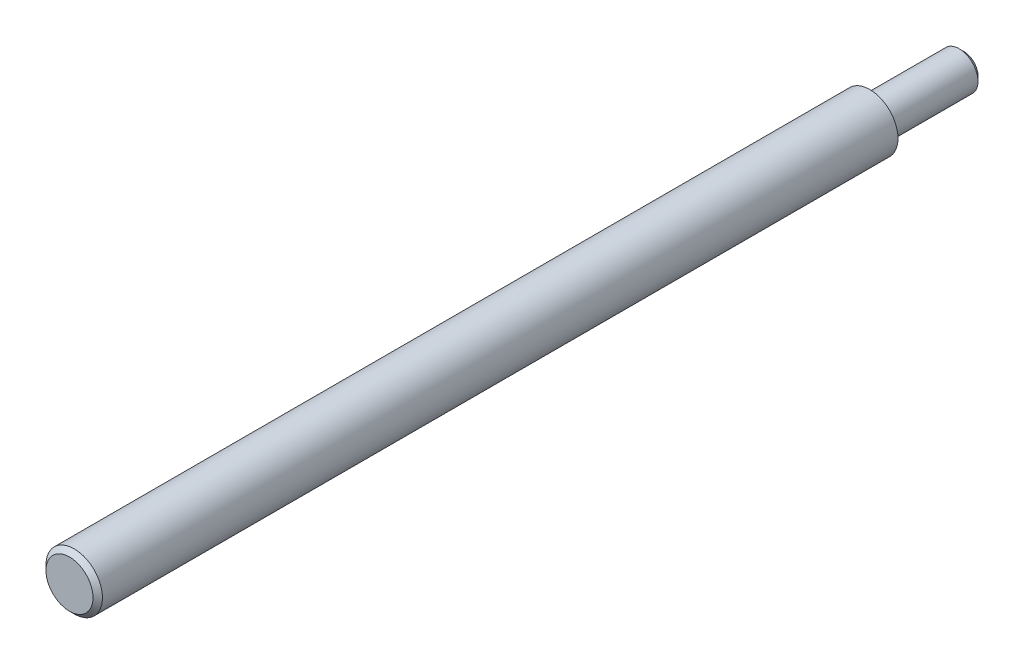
ISO-10303-21;
HEADER;
FILE_DESCRIPTION(('STEP AP214'),'2;1');
FILE_NAME('part.step','',(''),(''),'','','');
FILE_SCHEMA(('AUTOMOTIVE_DESIGN { 1 0 10303 214 1 1 1 1 }'));
ENDSEC;
DATA;
#1=APPLICATION_CONTEXT('core data for automotive mechanical design processes');
#2=APPLICATION_PROTOCOL_DEFINITION('international standard','automotive_design',2000,#1);
#3=PRODUCT_CONTEXT('',#1,'mechanical');
#4=PRODUCT('Part','Part','',(#3));
#5=PRODUCT_RELATED_PRODUCT_CATEGORY('part','',(#4));
#6=PRODUCT_DEFINITION_FORMATION('','',#4);
#7=PRODUCT_DEFINITION_CONTEXT('part definition',#1,'design');
#8=PRODUCT_DEFINITION('design','',#6,#7);
#9=PRODUCT_DEFINITION_SHAPE('','',#8);
#10=(LENGTH_UNIT() NAMED_UNIT(*) SI_UNIT(.MILLI.,.METRE.));
#11=(NAMED_UNIT(*) PLANE_ANGLE_UNIT() SI_UNIT($,.RADIAN.));
#12=(NAMED_UNIT(*) SI_UNIT($,.STERADIAN.) SOLID_ANGLE_UNIT());
#13=UNCERTAINTY_MEASURE_WITH_UNIT(LENGTH_MEASURE(1.E-05),#10,'distance_accuracy_value','');
#14=(GEOMETRIC_REPRESENTATION_CONTEXT(3) GLOBAL_UNCERTAINTY_ASSIGNED_CONTEXT((#13)) GLOBAL_UNIT_ASSIGNED_CONTEXT((#10,
#11,#12)) REPRESENTATION_CONTEXT('',''));
#15=CARTESIAN_POINT('',(0.,0.,0.));
#16=DIRECTION('',(0.,0.,1.));
#17=DIRECTION('',(1.,0.,0.));
#18=AXIS2_PLACEMENT_3D('',#15,#16,#17);
#19=CARTESIAN_POINT('',(0.,0.,170.));
#20=DIRECTION('',(0.,0.,-1.));
#21=DIRECTION('',(-1.,0.,0.));
#22=AXIS2_PLACEMENT_3D('',#19,#20,#21);
#23=CYLINDRICAL_SURFACE('',#22,6.);
#24=CARTESIAN_POINT('',(0.,0.,169.));
#25=DIRECTION('',(0.,0.,1.));
#26=DIRECTION('',(1.,0.,0.));
#27=AXIS2_PLACEMENT_3D('',#24,#25,#26);
#28=CIRCLE('',#27,6.);
#29=CARTESIAN_POINT('',(6.,0.,169.));
#30=VERTEX_POINT('',#29);
#31=EDGE_CURVE('E48',#30,#30,#28,.F.);
#32=ORIENTED_EDGE('',*,*,#31,.T.);
#33=EDGE_LOOP('',(#32));
#34=FACE_BOUND('',#33,.T.);
#35=CARTESIAN_POINT('',(0.,0.,0.));
#36=DIRECTION('',(0.,0.,1.));
#37=DIRECTION('',(1.,0.,0.));
#38=AXIS2_PLACEMENT_3D('',#35,#36,#37);
#39=CIRCLE('',#38,6.);
#40=CARTESIAN_POINT('',(6.,0.,0.));
#41=VERTEX_POINT('',#40);
#42=EDGE_CURVE('E60',#41,#41,#39,.T.);
#43=ORIENTED_EDGE('',*,*,#42,.T.);
#44=EDGE_LOOP('',(#43));
#45=FACE_BOUND('',#44,.T.);
#46=ADVANCED_FACE('F37',(#34,#45),#23,.T.);
#47=CARTESIAN_POINT('',(0.,0.,170.));
#48=DIRECTION('',(0.,0.,1.));
#49=DIRECTION('',(1.,0.,0.));
#50=AXIS2_PLACEMENT_3D('',#47,#48,#49);
#51=PLANE('',#50);
#52=CARTESIAN_POINT('',(0.,0.,170.));
#53=DIRECTION('',(0.,0.,1.));
#54=DIRECTION('',(1.,0.,0.));
#55=AXIS2_PLACEMENT_3D('',#52,#53,#54);
#56=CIRCLE('',#55,5.);
#57=CARTESIAN_POINT('',(5.,0.,170.));
#58=VERTEX_POINT('',#57);
#59=EDGE_CURVE('E52',#58,#58,#56,.T.);
#60=ORIENTED_EDGE('',*,*,#59,.T.);
#61=EDGE_LOOP('',(#60));
#62=FACE_BOUND('',#61,.T.);
#63=ADVANCED_FACE('F68',(#62),#51,.T.);
#64=CARTESIAN_POINT('',(0.,0.,0.));
#65=DIRECTION('',(0.,0.,1.));
#66=DIRECTION('',(1.,0.,0.));
#67=AXIS2_PLACEMENT_3D('',#64,#65,#66);
#68=PLANE('',#67);
#69=CARTESIAN_POINT('',(0.,0.,0.));
#70=DIRECTION('',(0.,0.,1.));
#71=DIRECTION('',(1.,0.,0.));
#72=AXIS2_PLACEMENT_3D('',#69,#70,#71);
#73=CIRCLE('',#72,4.);
#74=CARTESIAN_POINT('',(4.,0.,0.));
#75=VERTEX_POINT('',#74);
#76=EDGE_CURVE('E57',#75,#75,#73,.F.);
#77=ORIENTED_EDGE('',*,*,#76,.F.);
#78=EDGE_LOOP('',(#77));
#79=FACE_BOUND('',#78,.T.);
#80=ORIENTED_EDGE('',*,*,#42,.F.);
#81=EDGE_LOOP('',(#80));
#82=FACE_BOUND('',#81,.T.);
#83=ADVANCED_FACE('F65',(#79,#82),#68,.F.);
#84=CARTESIAN_POINT('',(0.,0.,-20.));
#85=DIRECTION('',(0.,0.,1.));
#86=DIRECTION('',(1.,0.,0.));
#87=AXIS2_PLACEMENT_3D('',#84,#85,#86);
#88=CYLINDRICAL_SURFACE('',#87,4.);
#89=CARTESIAN_POINT('',(0.,0.,-19.));
#90=DIRECTION('',(0.,0.,-1.));
#91=DIRECTION('',(-1.,0.,0.));
#92=AXIS2_PLACEMENT_3D('',#89,#90,#91);
#93=CIRCLE('',#92,4.);
#94=CARTESIAN_POINT('',(-4.,0.,-19.));
#95=VERTEX_POINT('',#94);
#96=EDGE_CURVE('E10',#95,#95,#93,.F.);
#97=ORIENTED_EDGE('',*,*,#96,.T.);
#98=EDGE_LOOP('',(#97));
#99=FACE_BOUND('',#98,.T.);
#100=ORIENTED_EDGE('',*,*,#76,.T.);
#101=EDGE_LOOP('',(#100));
#102=FACE_BOUND('',#101,.T.);
#103=ADVANCED_FACE('F67',(#99,#102),#88,.T.);
#104=CARTESIAN_POINT('',(0.,0.,-20.));
#105=DIRECTION('',(0.,0.,-1.));
#106=DIRECTION('',(-1.,0.,0.));
#107=AXIS2_PLACEMENT_3D('',#104,#105,#106);
#108=PLANE('',#107);
#109=CARTESIAN_POINT('',(0.,0.,-20.));
#110=DIRECTION('',(0.,0.,-1.));
#111=DIRECTION('',(-1.,0.,0.));
#112=AXIS2_PLACEMENT_3D('',#109,#110,#111);
#113=CIRCLE('',#112,3.00000000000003);
#114=CARTESIAN_POINT('',(-3.00000000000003,0.,-20.));
#115=VERTEX_POINT('',#114);
#116=EDGE_CURVE('E44',#115,#115,#113,.T.);
#117=ORIENTED_EDGE('',*,*,#116,.T.);
#118=EDGE_LOOP('',(#117));
#119=FACE_BOUND('',#118,.T.);
#120=ADVANCED_FACE('F75',(#119),#108,.T.);
#121=CARTESIAN_POINT('',(0.,0.,170.));
#122=DIRECTION('',(0.,0.,-1.));
#123=DIRECTION('',(-1.,0.,0.));
#124=AXIS2_PLACEMENT_3D('',#121,#122,#123);
#125=CONICAL_SURFACE('',#124,5.,0.785398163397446);
#126=ORIENTED_EDGE('',*,*,#31,.F.);
#127=EDGE_LOOP('',(#126));
#128=FACE_BOUND('',#127,.T.);
#129=ORIENTED_EDGE('',*,*,#59,.F.);
#130=EDGE_LOOP('',(#129));
#131=FACE_BOUND('',#130,.T.);
#132=ADVANCED_FACE('F85',(#128,#131),#125,.T.);
#133=CARTESIAN_POINT('',(0.,0.,-20.));
#134=DIRECTION('',(0.,0.,1.));
#135=DIRECTION('',(1.,0.,0.));
#136=AXIS2_PLACEMENT_3D('',#133,#134,#135);
#137=CONICAL_SURFACE('',#136,3.00000000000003,0.785398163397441);
#138=ORIENTED_EDGE('',*,*,#96,.F.);
#139=EDGE_LOOP('',(#138));
#140=FACE_BOUND('',#139,.T.);
#141=ORIENTED_EDGE('',*,*,#116,.F.);
#142=EDGE_LOOP('',(#141));
#143=FACE_BOUND('',#142,.T.);
#144=ADVANCED_FACE('F39',(#140,#143),#137,.T.);
#145=CLOSED_SHELL('',(#46,#63,#83,#103,#120,#132,#144));
#146=MANIFOLD_SOLID_BREP('B2',#145);
#147=ADVANCED_BREP_SHAPE_REPRESENTATION('',(#18,#146),#14);
#148=SHAPE_DEFINITION_REPRESENTATION(#9,#147);
ENDSEC;
END-ISO-10303-21;
